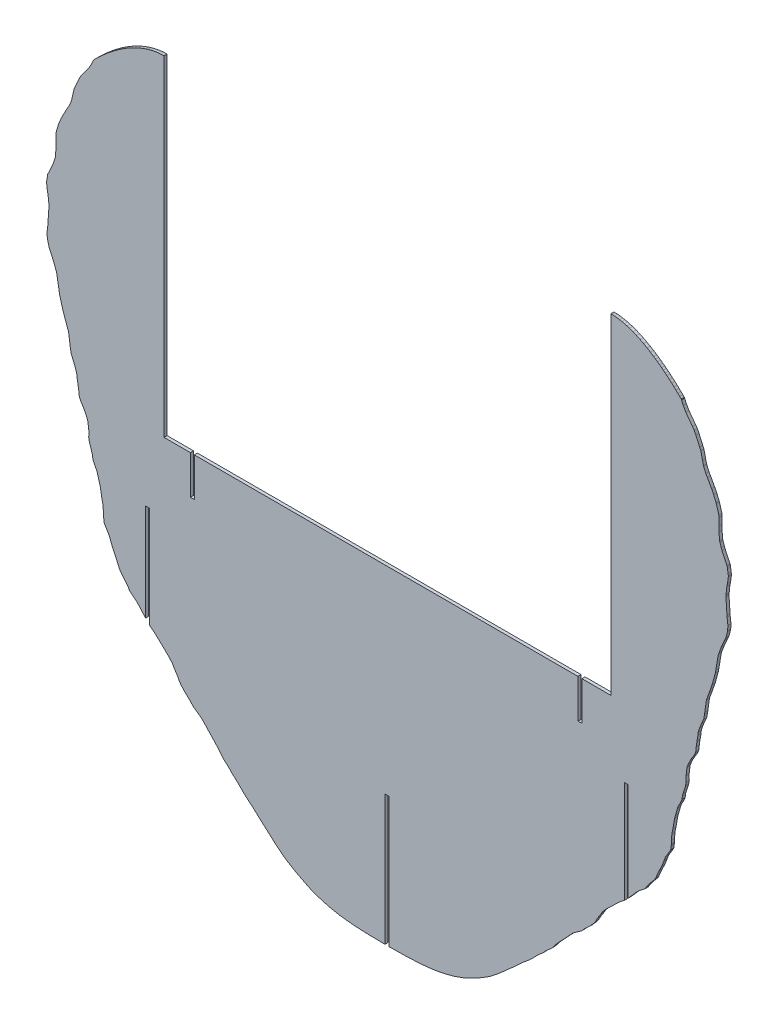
from build123d import *

# Parameters (mm, degrees)
EXTRUDE_1_DEPTH = 2


with BuildPart() as part:
    # Model → Extrude 1 (new body)
    with BuildSketch(Plane.XY):
        Polygon((-7682.8067, 1816.6971), (-7684.8067, 1816.6971), (-7685.0567, 1816.6971), (-7685.0567, 1732.4192), (-7694.5872, 1732.5452), (-7695.922, 1732.563), (-7696.6975, 1732.6032), (-7698.3765, 1732.6876), (-7705.6061, 1733.0389), (-7709.5556, 1733.4832), (-7714.152, 1734.023), (-7718.3061, 1734.8094), (-7721.3007, 1735.4051), (-7723.5175, 1736.0273), (-7726.4439, 1736.831), (-7730.4207, 1738.2057), (-7733.3113, 1739.2805), (-7735.5196, 1740.3507), (-7743.1818, 1744.2907), (-7743.234, 1744.3141), (-7743.2862, 1744.3375), (-7743.8617, 1744.6887), (-7743.9294, 1744.7294), (-7743.997, 1744.7701), (-7746.4079, 1746.2427), (-7746.9716, 1746.5727), (-7747.2628, 1746.7644), (-7748.5724, 1747.5636), (-7750.2895, 1748.7556), (-7750.4549, 1748.8644), (-7750.6203, 1748.9732), (-7750.7251, 1749.0581), (-7750.9248, 1749.1966), (-7752.0277, 1750.1115), (-7754.1352, 1751.8159), (-7756.559, 1753.7467), (-7757.454, 1754.6197), (-7758.2773, 1755.2931), (-7759.5082, 1756.4509), (-7764.286, 1760.6263), (-7767.697, 1763.7832), (-7769.7344, 1765.6174), (-7770.6738, 1766.5109), (-7770.8443, 1766.6855), (-7771.2598, 1767.0364), (-7771.6414, 1767.3061), (-7772.7886, 1768.2678), (-7774.9976, 1770.1285), (-7777.4658, 1772.4707), (-7780.2333, 1775.2889), (-7782.2505, 1777.1364), (-7784.5093, 1779.1408), (-7785.5694, 1780.417), (-7786.5279, 1781.2931), (-7790.0308, 1784.4159), (-7792.7157, 1787.8803), (-7793.3302, 1788.6343), (-7802.8222, 1798.7827), (-7803.1732, 1799.1838), (-7803.3726, 1799.3677), (-7803.4627, 1799.4482), (-7803.5528, 1799.5288), (-7805.7115, 1801.1681), (-7809.1877, 1803.6167), (-7811.2248, 1805.8476), (-7812.4073, 1807.0679), (-7814.2071, 1808.6109), (-7815.3023, 1809.8995), (-7816.1569, 1810.8578), (-7816.8136, 1811.4696), (-7817.0815, 1811.8237), (-7817.8921, 1812.8676), (-7819.7722, 1816.3454), (-7821.8108, 1819.4222), (-7822.5205, 1820.7525), (-7822.7491, 1821.1699), (-7823.9225, 1822.4968), (-7825.4693, 1824.1847), (-7825.544, 1824.2576), (-7825.6187, 1824.3305), (-7831.6382, 1830.1117), (-7834.2581, 1832.5858), (-7834.9102, 1833.0965), (-7837.0452, 1834.675), (-7837.5566, 1835.1293), (-7837.5566, 1900.7264), (-7837.8067, 1900.7264), (-7839.8067, 1900.7264), (-7840.0566, 1900.7264), (-7840.0566, 1837.8313), (-7843.3888, 1841.5625), (-7845.2083, 1843.6672), (-7846.4612, 1844.7876), (-7850.3521, 1847.8705), (-7850.5937, 1848.3136), (-7851.1968, 1849.394), (-7853.201, 1851.9539), (-7853.3551, 1852.2241), (-7853.5092, 1852.4941), (-7854.2362, 1853.3435), (-7856.4761, 1855.9941), (-7857.1615, 1857.2459), (-7859.3013, 1862.3312), (-7859.4154, 1862.5205), (-7859.5295, 1862.7099), (-7861.0658, 1865.8437), (-7862.3867, 1869.1102), (-7862.7143, 1870.1605), (-7863.5424, 1872.2092), (-7864.0264, 1873.0658), (-7865.7778, 1876.0008), (-7866.633, 1877.4193), (-7866.8648, 1877.8224), (-7866.8966, 1878.0422), (-7867.1363, 1879.9429), (-7867.149, 1880.0046), (-7867.1616, 1880.0663), (-7867.2687, 1880.8363), (-7867.2692, 1880.8931), (-7867.2697, 1880.9499), (-7867.3443, 1881.3376), (-7867.4187, 1881.7254), (-7867.4087, 1883.4935), (-7867.6081, 1887.1702), (-7868.324, 1890.5357), (-7869.4164, 1896.8975), (-7869.9439, 1898.7127), (-7871.2528, 1903.4152), (-7871.6748, 1904.7111), (-7872.5829, 1906.3719), (-7873.5435, 1908.2987), (-7874.2554, 1909.9143), (-7874.3811, 1911.7143), (-7874.9241, 1913.5987), (-7876.4357, 1918.3222), (-7876.5075, 1918.7488), (-7876.8971, 1920.8739), (-7876.8352, 1924.3529), (-7876.8524, 1924.7933), (-7877.4145, 1929.2624), (-7877.5814, 1929.9736), (-7878.2528, 1931.6759), (-7879.4857, 1934.2783), (-7880.6743, 1936.3831), (-7882.069, 1938.5015), (-7882.7613, 1940.0566), (-7883.0806, 1941.0658), (-7883.3842, 1943.9815), (-7883.8758, 1947.2676), (-7883.8871, 1947.3369), (-7883.8983, 1947.4062), (-7884.5602, 1951.0952), (-7884.661, 1952.5154), (-7884.6936, 1952.7341), (-7885.6231, 1955.6312), (-7886.7302, 1958.5313), (-7888.2287, 1961.8506), (-7888.786, 1964.8717), (-7888.8556, 1965.4174), (-7888.9253, 1965.963), (-7889.9683, 1973.4234), (-7891.7676, 1978.4349), (-7893.6808, 1983.8616), (-7895.7473, 1991.3936), (-7895.7672, 1991.4961), (-7895.7871, 1991.5986), (-7896.0503, 1993.1978), (-7897.7259, 2003.0528), (-7898.364, 2004.5166), (-7899.5729, 2007.9406), (-7901.8242, 2012.8467), (-7902.437, 2014.1933), (-7902.651, 2014.8167), (-7903.6461, 2018.7478), (-7903.6918, 2019.119), (-7903.7376, 2019.4904), (-7903.9089, 2022.2407), (-7903.3826, 2026.507), (-7903.3112, 2027.6613), (-7902.6491, 2037.4619), (-7902.5996, 2038.0979), (-7902.6064, 2038.2303), (-7902.6131, 2038.3627), (-7902.7473, 2039.1633), (-7903.2405, 2043.7789), (-7903.6573, 2045.608), (-7904.1864, 2049.674), (-7904.2077, 2049.8358), (-7904.229, 2049.9976), (-7904.2272, 2050.1142), (-7904.2173, 2050.2257), (-7904.2074, 2050.3372), (-7904.0686, 2051.2373), (-7903.647, 2053.9626), (-7903.4793, 2054.9942), (-7903.4503, 2055.0794), (-7903.4215, 2055.1646), (-7903.3057, 2055.4107), (-7903.19, 2055.6567), (-7900.1289, 2062.3024), (-7899.6081, 2063.6768), (-7898.7962, 2066.1643), (-7898.6095, 2066.6459), (-7898.5087, 2067.1734), (-7898.1421, 2071.8947), (-7898.0988, 2075.0473), (-7898.1437, 2079.9737), (-7898.054, 2081.1626), (-7896.399, 2086.8983), (-7896.3144, 2087.0912), (-7896.2298, 2087.2842), (-7894.642, 2091.0169), (-7893.3412, 2093.6799), (-7890.6491, 2098.5994), (-7889.605, 2100.3488), (-7888.2179, 2103.6898), (-7888.0739, 2104.0065), (-7887.4706, 2106.6902), (-7886.3467, 2111.6159), (-7885.6828, 2113.0454), (-7883.1785, 2118.6527), (-7882.0835, 2120.8909), (-7880.9262, 2122.5022), (-7876.7884, 2128.0555), (-7874.9889, 2131.2631), (-7873.9246, 2133.5749), (-7873.8578, 2133.6571), (-7873.6701, 2134.1511), (-7872.6506, 2135.1615), (-7871.5229, 2136.2575), (-7870.2915, 2137.4275), (-7868.961, 2138.6606), (-7867.5361, 2139.9453), (-7866.0212, 2141.2705), (-7864.4209, 2142.6246), (-7863.2887, 2143.5545), (-7862.1206, 2144.489), (-7860.9182, 2145.4246), (-7859.6829, 2146.3579), (-7858.416, 2147.2851), (-7857.1192, 2148.2031), (-7855.7937, 2149.108), (-7853.702, 2150.4668), (-7851.5512, 2151.7736), (-7849.3463, 2153.0155), (-7847.0928, 2154.18), (-7844.7957, 2155.2541), (-7842.4602, 2156.225), (-7840.0916, 2157.0797), (-7838.5056, 2157.5761), (-7836.9084, 2158.0124), (-7835.3014, 2158.3846), (-7833.6867, 2158.6889), (-7832.0659, 2158.9216), (-7830.4407, 2159.0789), (-7828.8128, 2159.1568), (-7828.0956, 2159.1632), (-7828.0956, 1945.1723), (-7811.0567, 1945.1723), (-7811.0567, 1920.115), (-7810.8067, 1920.115), (-7808.8067, 1920.115), (-7808.5567, 1920.115), (-7808.5567, 1945.1723), (-7560.0568, 1945.1723), (-7560.0568, 1920.115), (-7559.8067, 1920.115), (-7557.8067, 1920.115), (-7557.5568, 1920.115), (-7557.5568, 1945.1723), (-7538.8067, 1945.1723), (-7538.8067, 2159.1632), (-7538.4496, 2159.16), (-7538.0925, 2159.1568), (-7536.4644, 2159.079), (-7534.8387, 2158.9218), (-7533.2173, 2158.689), (-7531.602, 2158.3845), (-7529.9945, 2158.0123), (-7528.3967, 2157.5761), (-7526.8106, 2157.0797), (-7524.442, 2156.2251), (-7522.1064, 2155.2542), (-7519.8094, 2154.18), (-7517.5558, 2153.0155), (-7515.3511, 2151.7734), (-7513.2002, 2150.4667), (-7511.1086, 2149.108), (-7509.783, 2148.2031), (-7508.4861, 2147.2852), (-7507.2193, 2146.3578), (-7505.984, 2145.4246), (-7504.7816, 2144.4889), (-7503.6136, 2143.5545), (-7502.4813, 2142.6246), (-7500.8809, 2141.2706), (-7499.3661, 2139.9453), (-7497.9412, 2138.6606), (-7496.6107, 2137.4275), (-7495.3794, 2136.2573), (-7494.2516, 2135.1615), (-7493.2321, 2134.1511), (-7493.0444, 2133.6571), (-7492.9777, 2133.5749), (-7491.9133, 2131.2631), (-7490.1139, 2128.0555), (-7485.9761, 2122.5022), (-7484.8188, 2120.8909), (-7483.7238, 2118.6527), (-7481.2195, 2113.0454), (-7480.5555, 2111.6159), (-7479.4315, 2106.6902), (-7478.8284, 2104.0065), (-7478.6843, 2103.6898), (-7477.2972, 2100.3488), (-7476.2531, 2098.5994), (-7473.561, 2093.6799), (-7472.2602, 2091.0169), (-7470.6724, 2087.2842), (-7470.5879, 2087.0912), (-7470.5033, 2086.8983), (-7468.8483, 2081.1626), (-7468.7585, 2079.9737), (-7468.8035, 2075.0473), (-7468.7601, 2071.8947), (-7468.3935, 2067.1734), (-7468.2927, 2066.6459), (-7468.106, 2066.1643), (-7467.2942, 2063.6768), (-7466.7732, 2062.3024), (-7463.7123, 2055.6567), (-7463.4807, 2055.1646), (-7463.423, 2054.9942), (-7463.2552, 2053.9626), (-7462.8336, 2051.2373), (-7462.6983, 2050.3742), (-7462.6751, 2050.1142), (-7462.6732, 2050.0025), (-7462.7158, 2049.674), (-7463.245, 2045.608), (-7463.6618, 2043.7789), (-7464.155, 2039.1633), (-7464.2891, 2038.3627), (-7464.3026, 2038.0979), (-7464.2531, 2037.4619), (-7463.591, 2027.6613), (-7463.5197, 2026.507), (-7462.9933, 2022.2407), (-7463.1647, 2019.4904), (-7463.2561, 2018.7478), (-7464.2512, 2014.8167), (-7464.4652, 2014.1933), (-7465.078, 2012.8467), (-7467.3293, 2007.9406), (-7468.5382, 2004.5166), (-7469.1764, 2003.0528), (-7470.852, 1993.1978), (-7471.1151, 1991.5986), (-7471.1549, 1991.3936), (-7473.2214, 1983.8616), (-7475.1347, 1978.4349), (-7476.9339, 1973.4234), (-7477.9769, 1965.963), (-7478.1162, 1964.8717), (-7478.6736, 1961.8506), (-7480.172, 1958.5313), (-7481.2791, 1955.6312), (-7482.2072, 1952.7402), (-7482.2412, 1952.5154), (-7482.3421, 1951.0952), (-7483.0039, 1947.4062), (-7483.0264, 1947.2676), (-7483.5181, 1943.9815), (-7483.8216, 1941.0658), (-7484.141, 1940.0566), (-7484.8333, 1938.5015), (-7486.2279, 1936.3831), (-7487.4165, 1934.2783), (-7488.6493, 1931.6759), (-7489.3208, 1929.9736), (-7489.4878, 1929.2624), (-7490.0498, 1924.7933), (-7490.067, 1924.3529), (-7490.0052, 1920.8739), (-7490.3947, 1918.7488), (-7490.4665, 1918.3222), (-7491.9782, 1913.5987), (-7492.5211, 1911.7143), (-7492.6469, 1909.9143), (-7493.3587, 1908.2987), (-7494.3193, 1906.3719), (-7495.2274, 1904.7111), (-7495.6494, 1903.4152), (-7496.9583, 1898.7127), (-7497.4859, 1896.8975), (-7498.5782, 1890.5357), (-7499.2942, 1887.1702), (-7499.4935, 1883.4935), (-7499.4835, 1881.7254), (-7499.6325, 1880.9499), (-7499.6336, 1880.8363), (-7499.7405, 1880.0663), (-7499.766, 1879.9429), (-7500.0056, 1878.0422), (-7500.0375, 1877.8224), (-7500.2693, 1877.4193), (-7501.1244, 1876.0008), (-7502.8759, 1873.0658), (-7503.3598, 1872.2092), (-7504.188, 1870.1605), (-7504.5155, 1869.1102), (-7505.8364, 1865.8437), (-7507.3728, 1862.7099), (-7507.6009, 1862.3312), (-7509.7408, 1857.2459), (-7510.4261, 1855.9941), (-7512.6661, 1853.3435), (-7513.393, 1852.4941), (-7513.7013, 1851.9539), (-7515.7054, 1849.394), (-7516.3086, 1848.3136), (-7516.5321, 1847.8927), (-7520.441, 1844.7876), (-7521.694, 1843.6672), (-7523.5135, 1841.5625), (-7527.5567, 1837.0351), (-7527.5567, 1900.7264), (-7527.8067, 1900.7264), (-7529.8067, 1900.7264), (-7530.0567, 1900.7264), (-7530.0567, 1834.5274), (-7531.992, 1833.0965), (-7532.6441, 1832.5858), (-7535.264, 1830.1117), (-7541.2835, 1824.3305), (-7541.3582, 1824.2576), (-7541.433, 1824.1847), (-7542.9797, 1822.4968), (-7544.1531, 1821.1699), (-7544.3817, 1820.7525), (-7545.0914, 1819.4222), (-7547.13, 1816.3454), (-7549.0101, 1812.8676), (-7549.8207, 1811.8237), (-7550.0886, 1811.4696), (-7550.7454, 1810.8578), (-7551.5999, 1809.8995), (-7552.6952, 1808.6109), (-7554.495, 1807.0679), (-7555.6775, 1805.8476), (-7557.7146, 1803.6167), (-7561.1908, 1801.1681), (-7563.3494, 1799.5288), (-7563.4395, 1799.4482), (-7563.5297, 1799.3677), (-7563.729, 1799.1838), (-7564.08, 1798.7827), (-7573.572, 1788.6343), (-7574.1866, 1787.8803), (-7576.8715, 1784.4159), (-7580.3743, 1781.2931), (-7581.3328, 1780.417), (-7582.3929, 1779.1408), (-7584.6517, 1777.1364), (-7586.6689, 1775.2889), (-7589.4364, 1772.4707), (-7591.9046, 1770.1285), (-7594.1136, 1768.2678), (-7595.2609, 1767.3061), (-7595.4516, 1767.1713), (-7595.6424, 1767.0364), (-7596.0579, 1766.6855), (-7596.2285, 1766.5109), (-7597.1678, 1765.6174), (-7599.2053, 1763.7832), (-7602.6162, 1760.6263), (-7607.394, 1756.4509), (-7608.625, 1755.2931), (-7609.4482, 1754.6197), (-7610.3432, 1753.7467), (-7612.7671, 1751.8159), (-7614.8745, 1750.1115), (-7615.9774, 1749.1966), (-7616.1771, 1749.0581), (-7616.2295, 1749.0156), (-7616.282, 1748.9732), (-7616.4474, 1748.8644), (-7616.6128, 1748.7556), (-7618.3298, 1747.5636), (-7619.6394, 1746.7644), (-7619.785, 1746.6686), (-7619.9307, 1746.5727), (-7620.4943, 1746.2427), (-7622.9052, 1744.7701), (-7623.0405, 1744.6887), (-7623.6161, 1744.3375), (-7623.6682, 1744.3141), (-7623.7204, 1744.2907), (-7631.3827, 1740.3507), (-7633.5909, 1739.2805), (-7636.4815, 1738.2057), (-7640.4584, 1736.831), (-7643.3848, 1736.0273), (-7645.6016, 1735.4051), (-7648.5962, 1734.8094), (-7652.7502, 1734.023), (-7657.3467, 1733.4832), (-7661.2961, 1733.0389), (-7668.5257, 1732.6876), (-7670.2047, 1732.6032), (-7670.9802, 1732.563), (-7672.315, 1732.5452), (-7682.5567, 1732.4097), (-7682.5567, 1816.6971), align=None)
    extrude(amount=EXTRUDE_1_DEPTH)


solid = part.part
